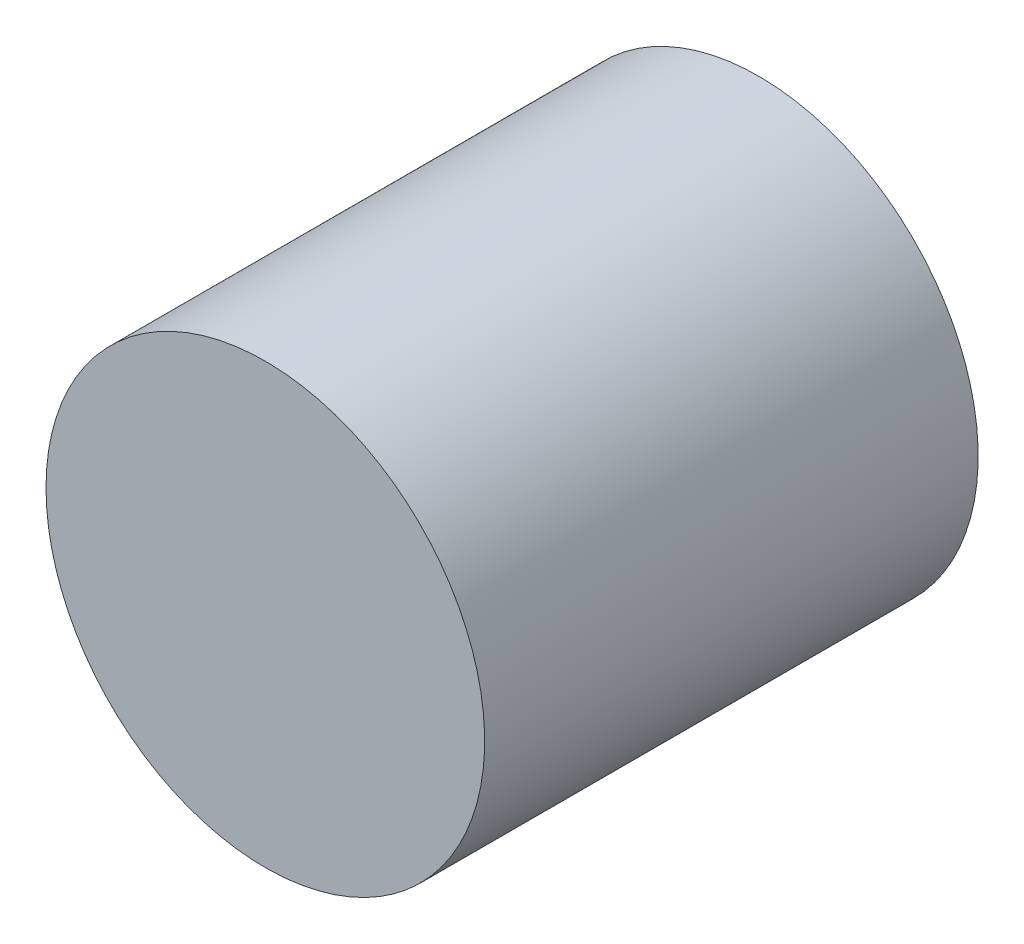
ISO-10303-21;
HEADER;
FILE_DESCRIPTION(('STEP AP214'),'2;1');
FILE_NAME('part.step','',(''),(''),'','','');
FILE_SCHEMA(('AUTOMOTIVE_DESIGN { 1 0 10303 214 1 1 1 1 }'));
ENDSEC;
DATA;
#1=APPLICATION_CONTEXT('core data for automotive mechanical design processes');
#2=APPLICATION_PROTOCOL_DEFINITION('international standard','automotive_design',2000,#1);
#3=PRODUCT_CONTEXT('',#1,'mechanical');
#4=PRODUCT('Part','Part','',(#3));
#5=PRODUCT_RELATED_PRODUCT_CATEGORY('part','',(#4));
#6=PRODUCT_DEFINITION_FORMATION('','',#4);
#7=PRODUCT_DEFINITION_CONTEXT('part definition',#1,'design');
#8=PRODUCT_DEFINITION('design','',#6,#7);
#9=PRODUCT_DEFINITION_SHAPE('','',#8);
#10=(LENGTH_UNIT() NAMED_UNIT(*) SI_UNIT(.MILLI.,.METRE.));
#11=(NAMED_UNIT(*) PLANE_ANGLE_UNIT() SI_UNIT($,.RADIAN.));
#12=(NAMED_UNIT(*) SI_UNIT($,.STERADIAN.) SOLID_ANGLE_UNIT());
#13=UNCERTAINTY_MEASURE_WITH_UNIT(LENGTH_MEASURE(1.E-05),#10,'distance_accuracy_value','');
#14=(GEOMETRIC_REPRESENTATION_CONTEXT(3) GLOBAL_UNCERTAINTY_ASSIGNED_CONTEXT((#13)) GLOBAL_UNIT_ASSIGNED_CONTEXT((#10,
#11,#12)) REPRESENTATION_CONTEXT('',''));
#15=CARTESIAN_POINT('',(0.,0.,0.));
#16=DIRECTION('',(0.,0.,1.));
#17=DIRECTION('',(1.,0.,0.));
#18=AXIS2_PLACEMENT_3D('',#15,#16,#17);
#19=CARTESIAN_POINT('',(0.,0.,0.));
#20=DIRECTION('',(0.,0.,-1.));
#21=DIRECTION('',(-1.,0.,0.));
#22=AXIS2_PLACEMENT_3D('',#19,#20,#21);
#23=CYLINDRICAL_SURFACE('',#22,2.5);
#24=CARTESIAN_POINT('',(0.,0.,6.));
#25=DIRECTION('',(0.,0.,-1.));
#26=DIRECTION('',(-1.,0.,0.));
#27=AXIS2_PLACEMENT_3D('',#24,#25,#26);
#28=CIRCLE('',#27,2.5);
#29=CARTESIAN_POINT('',(-2.5,0.,6.));
#30=VERTEX_POINT('',#29);
#31=EDGE_CURVE('E51',#30,#30,#28,.T.);
#32=ORIENTED_EDGE('',*,*,#31,.F.);
#33=EDGE_LOOP('',(#32));
#34=FACE_BOUND('',#33,.T.);
#35=CARTESIAN_POINT('',(0.,0.,0.));
#36=DIRECTION('',(0.,0.,-1.));
#37=DIRECTION('',(-1.,0.,0.));
#38=AXIS2_PLACEMENT_3D('',#35,#36,#37);
#39=CIRCLE('',#38,2.5);
#40=CARTESIAN_POINT('',(-2.5,0.,0.));
#41=VERTEX_POINT('',#40);
#42=EDGE_CURVE('E10',#41,#41,#39,.T.);
#43=ORIENTED_EDGE('',*,*,#42,.T.);
#44=EDGE_LOOP('',(#43));
#45=FACE_BOUND('',#44,.T.);
#46=ADVANCED_FACE('F37',(#34,#45),#23,.F.);
#47=CARTESIAN_POINT('',(0.,-2.5,0.));
#48=DIRECTION('',(0.,0.,1.));
#49=DIRECTION('',(1.,0.,0.));
#50=AXIS2_PLACEMENT_3D('',#47,#48,#49);
#51=PLANE('',#50);
#52=ORIENTED_EDGE('',*,*,#42,.F.);
#53=EDGE_LOOP('',(#52));
#54=FACE_BOUND('',#53,.T.);
#55=CARTESIAN_POINT('',(0.,0.,0.));
#56=DIRECTION('',(0.,0.,-1.));
#57=DIRECTION('',(-1.,0.,0.));
#58=AXIS2_PLACEMENT_3D('',#55,#56,#57);
#59=CIRCLE('',#58,4.);
#60=CARTESIAN_POINT('',(-4.,0.,0.));
#61=VERTEX_POINT('',#60);
#62=EDGE_CURVE('E43',#61,#61,#59,.T.);
#63=ORIENTED_EDGE('',*,*,#62,.T.);
#64=EDGE_LOOP('',(#63));
#65=FACE_BOUND('',#64,.T.);
#66=ADVANCED_FACE('F60',(#54,#65),#51,.F.);
#67=CARTESIAN_POINT('',(0.,0.,0.));
#68=DIRECTION('',(0.,0.,-1.));
#69=DIRECTION('',(-1.,0.,0.));
#70=AXIS2_PLACEMENT_3D('',#67,#68,#69);
#71=CYLINDRICAL_SURFACE('',#70,4.);
#72=ORIENTED_EDGE('',*,*,#62,.F.);
#73=EDGE_LOOP('',(#72));
#74=FACE_BOUND('',#73,.T.);
#75=CARTESIAN_POINT('',(0.,0.,9.));
#76=DIRECTION('',(0.,0.,-1.));
#77=DIRECTION('',(-1.,0.,0.));
#78=AXIS2_PLACEMENT_3D('',#75,#76,#77);
#79=CIRCLE('',#78,4.);
#80=CARTESIAN_POINT('',(-4.,0.,9.));
#81=VERTEX_POINT('',#80);
#82=EDGE_CURVE('E47',#81,#81,#79,.T.);
#83=ORIENTED_EDGE('',*,*,#82,.T.);
#84=EDGE_LOOP('',(#83));
#85=FACE_BOUND('',#84,.T.);
#86=ADVANCED_FACE('F64',(#74,#85),#71,.T.);
#87=CARTESIAN_POINT('',(0.,-4.,9.));
#88=DIRECTION('',(0.,0.,-1.));
#89=DIRECTION('',(-1.,0.,0.));
#90=AXIS2_PLACEMENT_3D('',#87,#88,#89);
#91=PLANE('',#90);
#92=ORIENTED_EDGE('',*,*,#82,.F.);
#93=EDGE_LOOP('',(#92));
#94=FACE_BOUND('',#93,.T.);
#95=ADVANCED_FACE('F69',(#94),#91,.F.);
#96=CARTESIAN_POINT('',(0.,0.,6.));
#97=DIRECTION('',(0.,0.,1.));
#98=DIRECTION('',(1.,0.,0.));
#99=AXIS2_PLACEMENT_3D('',#96,#97,#98);
#100=PLANE('',#99);
#101=ORIENTED_EDGE('',*,*,#31,.T.);
#102=EDGE_LOOP('',(#101));
#103=FACE_BOUND('',#102,.T.);
#104=ADVANCED_FACE('F57',(#103),#100,.F.);
#105=CLOSED_SHELL('',(#46,#66,#86,#95,#104));
#106=MANIFOLD_SOLID_BREP('B2',#105);
#107=ADVANCED_BREP_SHAPE_REPRESENTATION('',(#18,#106),#14);
#108=SHAPE_DEFINITION_REPRESENTATION(#9,#107);
ENDSEC;
END-ISO-10303-21;
